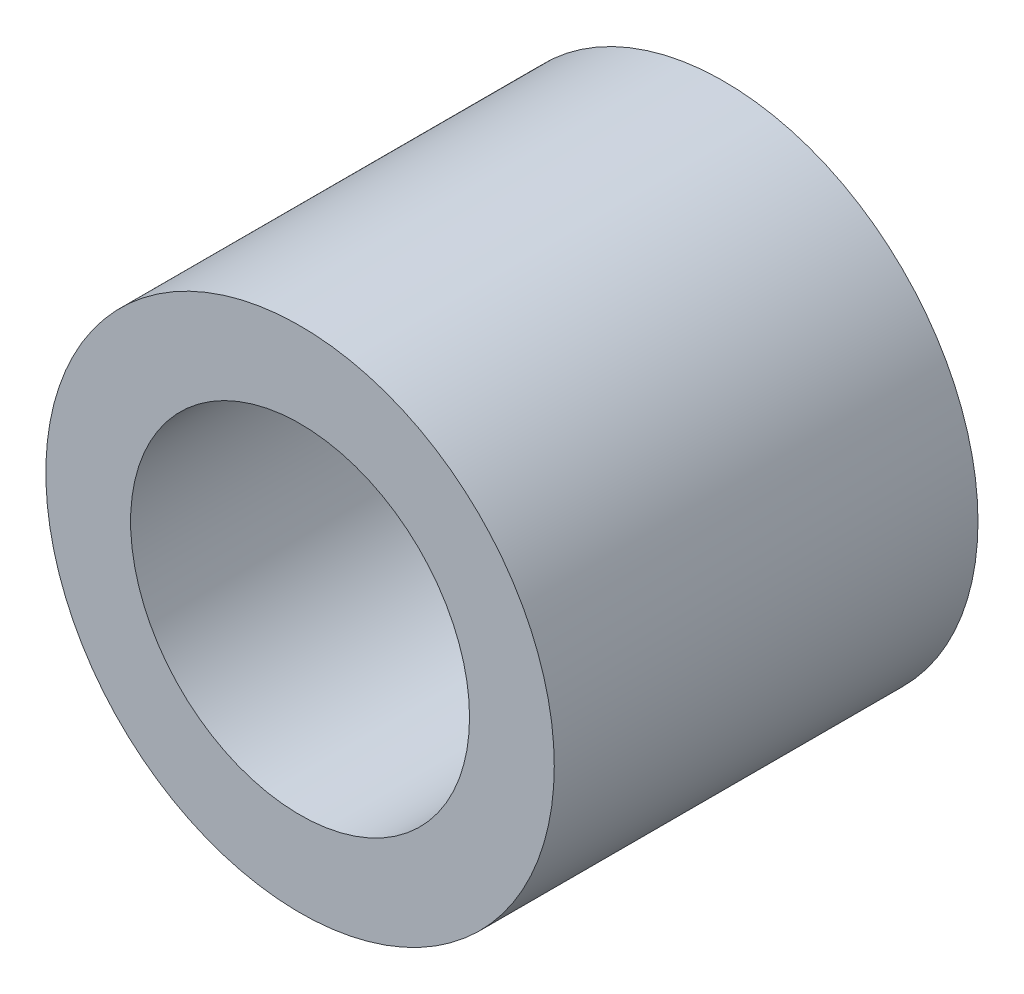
from build123d import *

# Parameters (mm, degrees)
SKIZZE1_R                       = 6
SKIZZE1_R_2                     = 4
AUFSATZ_LINEAR_AUSTRAGEN1_DEPTH = 5


with BuildPart() as part:
    # Skizze1 → Aufsatz-Linear austragen1 (new, symmetric)
    with BuildSketch(Plane.XY):
        Circle(SKIZZE1_R)
        Circle(SKIZZE1_R_2, mode=Mode.SUBTRACT)
    extrude(amount=AUFSATZ_LINEAR_AUSTRAGEN1_DEPTH, both=True)


solid = part.part
